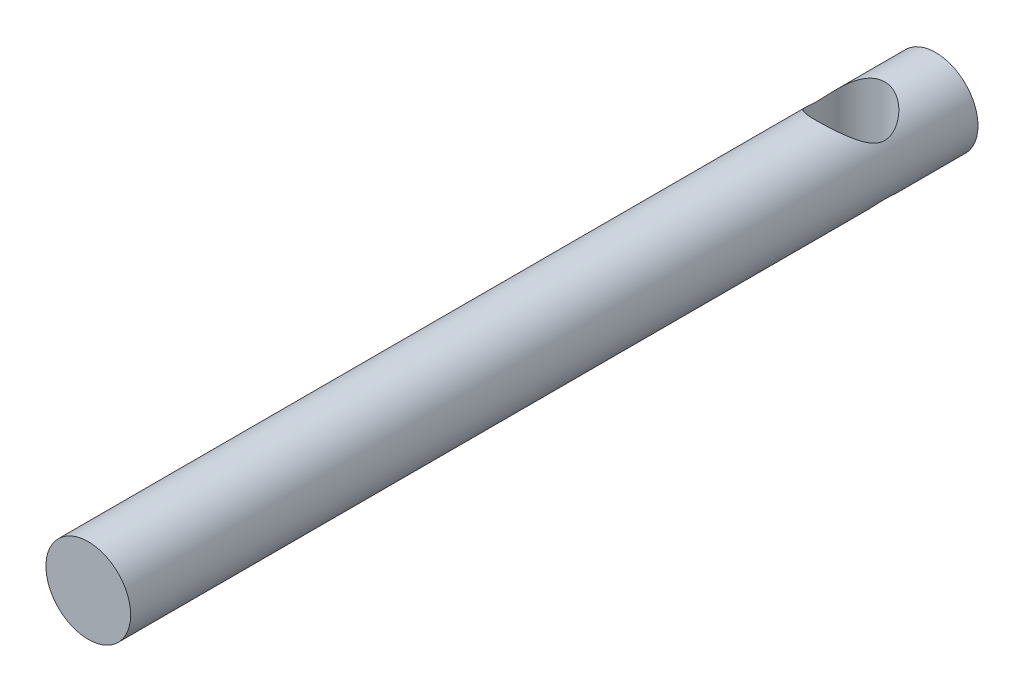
ISO-10303-21;
HEADER;
FILE_DESCRIPTION(('STEP AP214'),'2;1');
FILE_NAME('part.step','',(''),(''),'','','');
FILE_SCHEMA(('AUTOMOTIVE_DESIGN { 1 0 10303 214 1 1 1 1 }'));
ENDSEC;
DATA;
#1=APPLICATION_CONTEXT('core data for automotive mechanical design processes');
#2=APPLICATION_PROTOCOL_DEFINITION('international standard','automotive_design',2000,#1);
#3=PRODUCT_CONTEXT('',#1,'mechanical');
#4=PRODUCT('Part','Part','',(#3));
#5=PRODUCT_RELATED_PRODUCT_CATEGORY('part','',(#4));
#6=PRODUCT_DEFINITION_FORMATION('','',#4);
#7=PRODUCT_DEFINITION_CONTEXT('part definition',#1,'design');
#8=PRODUCT_DEFINITION('design','',#6,#7);
#9=PRODUCT_DEFINITION_SHAPE('','',#8);
#10=(LENGTH_UNIT() NAMED_UNIT(*) SI_UNIT(.MILLI.,.METRE.));
#11=(NAMED_UNIT(*) PLANE_ANGLE_UNIT() SI_UNIT($,.RADIAN.));
#12=(NAMED_UNIT(*) SI_UNIT($,.STERADIAN.) SOLID_ANGLE_UNIT());
#13=UNCERTAINTY_MEASURE_WITH_UNIT(LENGTH_MEASURE(1.E-05),#10,'distance_accuracy_value','');
#14=(GEOMETRIC_REPRESENTATION_CONTEXT(3) GLOBAL_UNCERTAINTY_ASSIGNED_CONTEXT((#13)) GLOBAL_UNIT_ASSIGNED_CONTEXT((#10,
#11,#12)) REPRESENTATION_CONTEXT('',''));
#15=CARTESIAN_POINT('',(0.,0.,0.));
#16=DIRECTION('',(0.,0.,1.));
#17=DIRECTION('',(1.,0.,0.));
#18=AXIS2_PLACEMENT_3D('',#15,#16,#17);
#19=CARTESIAN_POINT('',(0.,0.,50.));
#20=DIRECTION('',(0.,0.,-1.));
#21=DIRECTION('',(-1.,0.,0.));
#22=AXIS2_PLACEMENT_3D('',#19,#20,#21);
#23=CYLINDRICAL_SURFACE('',#22,5.);
#24=CARTESIAN_POINT('',(0.,-5.,-36.));
#25=CARTESIAN_POINT('',(0.0960463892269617,-4.99999925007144,-36.0000007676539));
#26=CARTESIAN_POINT('',(0.192107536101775,-4.99722609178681,-36.0034657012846));
#27=CARTESIAN_POINT('',(0.383456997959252,-4.98619644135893,-36.0172658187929));
#28=CARTESIAN_POINT('',(0.478744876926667,-4.97793704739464,-36.0276046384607));
#29=CARTESIAN_POINT('',(0.667896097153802,-4.95610616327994,-36.0549958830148));
#30=CARTESIAN_POINT('',(0.76175685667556,-4.94252601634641,-36.0720592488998));
#31=CARTESIAN_POINT('',(0.947221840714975,-4.91036147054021,-36.1126101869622));
#32=CARTESIAN_POINT('',(1.0388250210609,-4.89177480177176,-36.1361006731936));
#33=CARTESIAN_POINT('',(1.30807557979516,-4.82935106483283,-36.2153329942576));
#34=CARTESIAN_POINT('',(1.48159866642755,-4.77867586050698,-36.2800510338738));
#35=CARTESIAN_POINT('',(1.81389737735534,-4.66270676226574,-36.4302503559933));
#36=CARTESIAN_POINT('',(1.97267295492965,-4.59741282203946,-36.5157317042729));
#37=CARTESIAN_POINT('',(2.2248639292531,-4.47912821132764,-36.6736868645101));
#38=CARTESIAN_POINT('',(2.32274021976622,-4.42904400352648,-36.7413473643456));
#39=CARTESIAN_POINT('',(2.51087921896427,-4.3251620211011,-36.8840057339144));
#40=CARTESIAN_POINT('',(2.60114198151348,-4.27136427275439,-36.9590035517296));
#41=CARTESIAN_POINT('',(2.77417073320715,-4.16107388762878,-37.1159636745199));
#42=CARTESIAN_POINT('',(2.85691378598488,-4.10457375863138,-37.1979459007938));
#43=CARTESIAN_POINT('',(3.01451382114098,-3.99026026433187,-37.3682397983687));
#44=CARTESIAN_POINT('',(3.08937383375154,-3.93244741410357,-37.4565490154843));
#45=CARTESIAN_POINT('',(3.23229007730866,-3.81587933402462,-37.6407406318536));
#46=CARTESIAN_POINT('',(3.30022025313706,-3.75712363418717,-37.7367205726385));
#47=CARTESIAN_POINT('',(3.42776995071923,-3.64112939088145,-37.9349832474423));
#48=CARTESIAN_POINT('',(3.48738684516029,-3.58389133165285,-38.0372679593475));
#49=CARTESIAN_POINT('',(3.59782503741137,-3.47300406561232,-38.247927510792));
#50=CARTESIAN_POINT('',(3.64867015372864,-3.41934539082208,-38.3562847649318));
#51=CARTESIAN_POINT('',(3.74117870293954,-3.31787465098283,-38.5793826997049));
#52=CARTESIAN_POINT('',(3.78284998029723,-3.2700576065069,-38.6941178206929));
#53=CARTESIAN_POINT('',(3.86171422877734,-3.17670210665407,-38.947710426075));
#54=CARTESIAN_POINT('',(3.89730775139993,-3.1325716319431,-39.0876106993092));
#55=CARTESIAN_POINT('',(3.95346969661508,-3.06140069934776,-39.3744381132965));
#56=CARTESIAN_POINT('',(3.97407505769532,-3.03431824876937,-39.5213470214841));
#57=CARTESIAN_POINT('',(3.99879637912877,-3.0016839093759,-39.8203813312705));
#58=CARTESIAN_POINT('',(4.00276700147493,-2.99632180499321,-39.9725410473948));
#59=CARTESIAN_POINT('',(3.99338954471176,-3.00879937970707,-40.2754117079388));
#60=CARTESIAN_POINT('',(3.98002680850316,-3.02665869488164,-40.4261213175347));
#61=CARTESIAN_POINT('',(3.93390695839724,-3.08641470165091,-40.7444399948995));
#62=CARTESIAN_POINT('',(3.89843994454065,-3.13163820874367,-40.9109987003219));
#63=CARTESIAN_POINT('',(3.80888715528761,-3.2399478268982,-41.2330884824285));
#64=CARTESIAN_POINT('',(3.75474623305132,-3.30308674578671,-41.388585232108));
#65=CARTESIAN_POINT('',(3.6459308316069,-3.42227632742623,-41.6497837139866));
#66=CARTESIAN_POINT('',(3.59488537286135,-3.4760534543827,-41.7581007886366));
#67=CARTESIAN_POINT('',(3.48415594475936,-3.58703185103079,-41.9684490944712));
#68=CARTESIAN_POINT('',(3.42446798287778,-3.64423469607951,-42.0704773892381));
#69=CARTESIAN_POINT('',(3.29671153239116,-3.76020626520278,-42.2683872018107));
#70=CARTESIAN_POINT('',(3.22863333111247,-3.81897674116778,-42.3642613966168));
#71=CARTESIAN_POINT('',(3.08431402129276,-3.93645333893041,-42.5496673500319));
#72=CARTESIAN_POINT('',(3.00807425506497,-3.99515946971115,-42.639200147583));
#73=CARTESIAN_POINT('',(2.84534419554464,-4.11270704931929,-42.8140101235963));
#74=CARTESIAN_POINT('',(2.75863401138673,-4.17150999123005,-42.8991090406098));
#75=CARTESIAN_POINT('',(2.5767399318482,-4.28625477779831,-43.0619130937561));
#76=CARTESIAN_POINT('',(2.48155479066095,-4.34219619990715,-43.1396171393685));
#77=CARTESIAN_POINT('',(2.28307653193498,-4.44974832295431,-43.2867573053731));
#78=CARTESIAN_POINT('',(2.17980247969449,-4.50136864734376,-43.3562119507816));
#79=CARTESIAN_POINT('',(1.96536649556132,-4.59904750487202,-43.4861249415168));
#80=CARTESIAN_POINT('',(1.85420815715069,-4.64510854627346,-43.5465873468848));
#81=CARTESIAN_POINT('',(1.57560055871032,-4.7484549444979,-43.6810867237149));
#82=CARTESIAN_POINT('',(1.40425498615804,-4.80222795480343,-43.7500220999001));
#83=CARTESIAN_POINT('',(1.13837354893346,-4.86955008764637,-43.8357293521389));
#84=CARTESIAN_POINT('',(1.0482500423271,-4.88977064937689,-43.8613525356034));
#85=CARTESIAN_POINT('',(0.86554055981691,-4.92539137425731,-43.9063630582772));
#86=CARTESIAN_POINT('',(0.772955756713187,-4.94079379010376,-43.9257533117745));
#87=CARTESIAN_POINT('',(0.58541259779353,-4.96651844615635,-43.9580805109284));
#88=CARTESIAN_POINT('',(0.490443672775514,-4.97681103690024,-43.9709797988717));
#89=CARTESIAN_POINT('',(0.299430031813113,-4.99194513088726,-43.9899309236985));
#90=CARTESIAN_POINT('',(0.203385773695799,-4.99678887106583,-43.9959855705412));
#91=CARTESIAN_POINT('',(0.0109789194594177,-5.00091325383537,-44.0011418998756));
#92=CARTESIAN_POINT('',(-0.0853836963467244,-5.00019354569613,-44.0002431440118));
#93=CARTESIAN_POINT('',(-0.277564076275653,-4.9932177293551,-43.9915194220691));
#94=CARTESIAN_POINT('',(-0.373381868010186,-4.9869619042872,-43.9836948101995));
#95=CARTESIAN_POINT('',(-0.643376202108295,-4.96153018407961,-43.9518293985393));
#96=CARTESIAN_POINT('',(-0.816090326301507,-4.93592517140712,-43.9197003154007));
#97=CARTESIAN_POINT('',(-1.15270281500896,-4.86835214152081,-43.8342569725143));
#98=CARTESIAN_POINT('',(-1.31659854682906,-4.82637926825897,-43.7809364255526));
#99=CARTESIAN_POINT('',(-1.64246254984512,-4.72579643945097,-43.6516988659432));
#100=CARTESIAN_POINT('',(-1.80368475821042,-4.66631810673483,-43.5745883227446));
#101=CARTESIAN_POINT('',(-2.11082248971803,-4.53567260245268,-43.4022758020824));
#102=CARTESIAN_POINT('',(-2.25673724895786,-4.4645048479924,-43.3070729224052));
#103=CARTESIAN_POINT('',(-2.55850389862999,-4.29987369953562,-43.0815513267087));
#104=CARTESIAN_POINT('',(-2.71101415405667,-4.20473938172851,-42.9479966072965));
#105=CARTESIAN_POINT('',(-2.99307397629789,-4.00886997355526,-42.6612260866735));
#106=CARTESIAN_POINT('',(-3.12255559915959,-3.90811942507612,-42.5079543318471));
#107=CARTESIAN_POINT('',(-3.31136973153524,-3.74748270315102,-42.2471311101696));
#108=CARTESIAN_POINT('',(-3.3782748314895,-3.68709486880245,-42.1452788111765));
#109=CARTESIAN_POINT('',(-3.50310004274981,-3.56870831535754,-41.9347554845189));
#110=CARTESIAN_POINT('',(-3.5610153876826,-3.51071087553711,-41.8260808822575));
#111=CARTESIAN_POINT('',(-3.6671754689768,-3.39966227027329,-41.602221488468));
#112=CARTESIAN_POINT('',(-3.71545356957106,-3.34659439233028,-41.487060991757));
#113=CARTESIAN_POINT('',(-3.80178930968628,-3.24818077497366,-41.2499190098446));
#114=CARTESIAN_POINT('',(-3.83985955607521,-3.20282553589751,-41.1279461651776));
#115=CARTESIAN_POINT('',(-3.90720331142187,-3.12038840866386,-40.8678265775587));
#116=CARTESIAN_POINT('',(-3.9355911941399,-3.08419433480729,-40.729154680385));
#117=CARTESIAN_POINT('',(-3.9775781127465,-3.02986743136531,-40.4463247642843));
#118=CARTESIAN_POINT('',(-3.9912144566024,-3.01168904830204,-40.302181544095));
#119=CARTESIAN_POINT('',(-4.00264117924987,-2.99649473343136,-40.0113026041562));
#120=CARTESIAN_POINT('',(-4.00034641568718,-2.9995925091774,-39.864557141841));
#121=CARTESIAN_POINT('',(-3.97993037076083,-3.02661544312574,-39.574031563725));
#122=CARTESIAN_POINT('',(-3.96178399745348,-3.05057362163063,-39.4302565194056));
#123=CARTESIAN_POINT('',(-3.90415501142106,-3.12414149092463,-39.1107866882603));
#124=CARTESIAN_POINT('',(-3.8601850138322,-3.17898498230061,-38.9371548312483));
#125=CARTESIAN_POINT('',(-3.75216313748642,-3.30577833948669,-38.6027320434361));
#126=CARTESIAN_POINT('',(-3.68805209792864,-3.37777844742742,-38.4419807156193));
#127=CARTESIAN_POINT('',(-3.56189718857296,-3.50982146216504,-38.1756497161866));
#128=CARTESIAN_POINT('',(-3.50405339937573,-3.56777397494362,-38.0669752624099));
#129=CARTESIAN_POINT('',(-3.3792939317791,-3.68615802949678,-37.8563190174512));
#130=CARTESIAN_POINT('',(-3.31237456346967,-3.74659057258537,-37.7543399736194));
#131=CARTESIAN_POINT('',(-3.16965616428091,-3.86808457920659,-37.5570272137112));
#132=CARTESIAN_POINT('',(-3.09384874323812,-3.92914658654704,-37.4616999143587));
#133=CARTESIAN_POINT('',(-2.93352249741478,-4.05025163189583,-37.2779962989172));
#134=CARTESIAN_POINT('',(-2.84900504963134,-4.11029482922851,-37.1896188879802));
#135=CARTESIAN_POINT('',(-2.67014072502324,-4.22871182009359,-37.019091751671));
#136=CARTESIAN_POINT('',(-2.57567862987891,-4.28705303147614,-36.9370398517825));
#137=CARTESIAN_POINT('',(-2.37797638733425,-4.39979346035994,-36.7811370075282));
#138=CARTESIAN_POINT('',(-2.27473478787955,-4.45419202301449,-36.7072874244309));
#139=CARTESIAN_POINT('',(-2.05999159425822,-4.55747526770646,-36.5688634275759));
#140=CARTESIAN_POINT('',(-1.94851057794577,-4.60637296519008,-36.5042670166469));
#141=CARTESIAN_POINT('',(-1.71770987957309,-4.69732670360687,-36.3852598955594));
#142=CARTESIAN_POINT('',(-1.59839505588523,-4.73938692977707,-36.3308429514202));
#143=CARTESIAN_POINT('',(-1.31004257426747,-4.82841831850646,-36.2164381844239));
#144=CARTESIAN_POINT('',(-1.13806652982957,-4.87206678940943,-36.1610196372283));
#145=CARTESIAN_POINT('',(-0.873484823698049,-4.92393545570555,-36.095475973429));
#146=CARTESIAN_POINT('',(-0.7842574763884,-4.93895148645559,-36.0765663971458));
#147=CARTESIAN_POINT('',(-0.604069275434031,-4.96420704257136,-36.0448202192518));
#148=CARTESIAN_POINT('',(-0.513109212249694,-4.97444869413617,-36.0319809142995));
#149=CARTESIAN_POINT('',(-0.351776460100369,-4.9881031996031,-36.0148786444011));
#150=CARTESIAN_POINT('',(-0.281625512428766,-4.99255849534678,-36.0093051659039));
#151=CARTESIAN_POINT('',(-0.140985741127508,-4.99850750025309,-36.0018651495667));
#152=CARTESIAN_POINT('',(-0.0704968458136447,-5.00000055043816,-35.9999994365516));
#153=CARTESIAN_POINT('',(0.,-5.,-36.));
#154=B_SPLINE_CURVE_WITH_KNOTS('',3,(#24,#25,#26,#27,#28,#29,#30,#31,#32,#33,#34,#35,#36,#37,
#38,#39,#40,#41,#42,#43,#44,#45,#46,#47,#48,#49,#50,#51,#52,#53,#54,#55,#56,#57,#58,#59,#60,#61,
#62,#63,#64,#65,#66,#67,#68,#69,#70,#71,#72,#73,#74,#75,#76,#77,#78,#79,#80,#81,#82,#83,#84,#85,
#86,#87,#88,#89,#90,#91,#92,#93,#94,#95,#96,#97,#98,#99,#100,#101,#102,#103,#104,#105,#106,#107,
#108,#109,#110,#111,#112,#113,#114,#115,#116,#117,#118,#119,#120,#121,#122,#123,#124,#125,#126,
#127,#128,#129,#130,#131,#132,#133,#134,#135,#136,#137,#138,#139,#140,#141,#142,#143,#144,#145,
#146,#147,#148,#149,#150,#151,#152,#153),.UNSPECIFIED.,.T.,.F.,(4,2,2,2,2,2,2,2,2,2,2,2,2,2,2,2,
2,2,2,2,2,2,2,2,2,2,2,2,2,2,2,2,2,2,2,2,2,2,2,2,2,2,2,2,2,2,2,2,2,2,2,2,2,2,2,2,2,2,2,2,2,2,2,2,
4),(0.,0.288062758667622,0.576278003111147,0.864964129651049,1.15378136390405,1.72709009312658,
2.30040063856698,2.68722645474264,3.07404953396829,3.46201544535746,3.84983167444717,
4.24376978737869,4.63783211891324,5.03080698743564,5.42344451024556,5.87474837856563,
6.32493619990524,6.77904922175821,7.23354649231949,7.75923125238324,8.28648192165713,
8.6798007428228,9.07330184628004,9.46726282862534,9.86115911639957,10.2656076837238,
10.6701158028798,11.0736976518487,11.4770967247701,12.0514034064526,12.3386733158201,
12.6258087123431,12.9145912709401,13.2032552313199,13.4919373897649,13.7806047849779,
14.3106110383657,14.8407746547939,15.4037260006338,15.9667054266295,16.6361816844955,
17.3076015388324,17.7152021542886,18.1230181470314,18.5293968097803,18.9352712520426,
19.3719136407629,19.8074491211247,20.2453140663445,20.6838733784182,21.242737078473,
21.8032579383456,22.2109901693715,22.6188886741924,23.0271753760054,23.4353976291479,
23.8490189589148,24.2627088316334,24.675398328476,25.0878342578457,25.6427442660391,
25.9197834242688,26.1966990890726,26.4080865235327,26.6195209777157),.UNSPECIFIED.);
#155=CARTESIAN_POINT('',(0.,-5.,-36.));
#156=VERTEX_POINT('',#155);
#157=EDGE_CURVE('E10',#156,#156,#154,.T.);
#158=ORIENTED_EDGE('',*,*,#157,.T.);
#159=EDGE_LOOP('',(#158));
#160=FACE_BOUND('',#159,.T.);
#161=CARTESIAN_POINT('',(0.,5.,-36.));
#162=CARTESIAN_POINT('',(-0.0960463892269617,4.99999925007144,-36.0000007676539));
#163=CARTESIAN_POINT('',(-0.192107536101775,4.99722609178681,-36.0034657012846));
#164=CARTESIAN_POINT('',(-0.383456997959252,4.98619644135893,-36.0172658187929));
#165=CARTESIAN_POINT('',(-0.478744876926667,4.97793704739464,-36.0276046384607));
#166=CARTESIAN_POINT('',(-0.667896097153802,4.95610616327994,-36.0549958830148));
#167=CARTESIAN_POINT('',(-0.76175685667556,4.94252601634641,-36.0720592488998));
#168=CARTESIAN_POINT('',(-0.947221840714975,4.91036147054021,-36.1126101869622));
#169=CARTESIAN_POINT('',(-1.0388250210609,4.89177480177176,-36.1361006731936));
#170=CARTESIAN_POINT('',(-1.30807557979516,4.82935106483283,-36.2153329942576));
#171=CARTESIAN_POINT('',(-1.48159866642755,4.77867586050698,-36.2800510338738));
#172=CARTESIAN_POINT('',(-1.81389737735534,4.66270676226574,-36.4302503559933));
#173=CARTESIAN_POINT('',(-1.97267295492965,4.59741282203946,-36.5157317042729));
#174=CARTESIAN_POINT('',(-2.2248639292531,4.47912821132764,-36.6736868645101));
#175=CARTESIAN_POINT('',(-2.32274021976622,4.42904400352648,-36.7413473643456));
#176=CARTESIAN_POINT('',(-2.51087921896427,4.3251620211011,-36.8840057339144));
#177=CARTESIAN_POINT('',(-2.60114198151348,4.27136427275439,-36.9590035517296));
#178=CARTESIAN_POINT('',(-2.77417073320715,4.16107388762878,-37.1159636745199));
#179=CARTESIAN_POINT('',(-2.85691378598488,4.10457375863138,-37.1979459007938));
#180=CARTESIAN_POINT('',(-3.01451382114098,3.99026026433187,-37.3682397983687));
#181=CARTESIAN_POINT('',(-3.08937383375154,3.93244741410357,-37.4565490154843));
#182=CARTESIAN_POINT('',(-3.23229007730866,3.81587933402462,-37.6407406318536));
#183=CARTESIAN_POINT('',(-3.30022025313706,3.75712363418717,-37.7367205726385));
#184=CARTESIAN_POINT('',(-3.42776995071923,3.64112939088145,-37.9349832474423));
#185=CARTESIAN_POINT('',(-3.48738684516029,3.58389133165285,-38.0372679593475));
#186=CARTESIAN_POINT('',(-3.59782503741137,3.47300406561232,-38.247927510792));
#187=CARTESIAN_POINT('',(-3.64867015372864,3.41934539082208,-38.3562847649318));
#188=CARTESIAN_POINT('',(-3.74117870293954,3.31787465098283,-38.5793826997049));
#189=CARTESIAN_POINT('',(-3.78284998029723,3.2700576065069,-38.6941178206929));
#190=CARTESIAN_POINT('',(-3.86171422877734,3.17670210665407,-38.947710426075));
#191=CARTESIAN_POINT('',(-3.89730775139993,3.1325716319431,-39.0876106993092));
#192=CARTESIAN_POINT('',(-3.95346969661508,3.06140069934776,-39.3744381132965));
#193=CARTESIAN_POINT('',(-3.97407505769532,3.03431824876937,-39.5213470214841));
#194=CARTESIAN_POINT('',(-3.99879637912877,3.0016839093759,-39.8203813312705));
#195=CARTESIAN_POINT('',(-4.00276700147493,2.99632180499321,-39.9725410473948));
#196=CARTESIAN_POINT('',(-3.99338954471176,3.00879937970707,-40.2754117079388));
#197=CARTESIAN_POINT('',(-3.98002680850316,3.02665869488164,-40.4261213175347));
#198=CARTESIAN_POINT('',(-3.93390695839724,3.08641470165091,-40.7444399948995));
#199=CARTESIAN_POINT('',(-3.89843994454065,3.13163820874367,-40.9109987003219));
#200=CARTESIAN_POINT('',(-3.80888715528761,3.2399478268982,-41.2330884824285));
#201=CARTESIAN_POINT('',(-3.75474623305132,3.30308674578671,-41.388585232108));
#202=CARTESIAN_POINT('',(-3.6459308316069,3.42227632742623,-41.6497837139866));
#203=CARTESIAN_POINT('',(-3.59488537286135,3.4760534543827,-41.7581007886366));
#204=CARTESIAN_POINT('',(-3.48415594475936,3.58703185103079,-41.9684490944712));
#205=CARTESIAN_POINT('',(-3.42446798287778,3.64423469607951,-42.0704773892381));
#206=CARTESIAN_POINT('',(-3.29671153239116,3.76020626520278,-42.2683872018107));
#207=CARTESIAN_POINT('',(-3.22863333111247,3.81897674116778,-42.3642613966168));
#208=CARTESIAN_POINT('',(-3.08431402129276,3.93645333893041,-42.5496673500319));
#209=CARTESIAN_POINT('',(-3.00807425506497,3.99515946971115,-42.639200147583));
#210=CARTESIAN_POINT('',(-2.84534419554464,4.11270704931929,-42.8140101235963));
#211=CARTESIAN_POINT('',(-2.75863401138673,4.17150999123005,-42.8991090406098));
#212=CARTESIAN_POINT('',(-2.5767399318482,4.28625477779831,-43.0619130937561));
#213=CARTESIAN_POINT('',(-2.48155479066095,4.34219619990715,-43.1396171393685));
#214=CARTESIAN_POINT('',(-2.28307653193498,4.44974832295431,-43.2867573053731));
#215=CARTESIAN_POINT('',(-2.17980247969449,4.50136864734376,-43.3562119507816));
#216=CARTESIAN_POINT('',(-1.96536649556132,4.59904750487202,-43.4861249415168));
#217=CARTESIAN_POINT('',(-1.85420815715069,4.64510854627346,-43.5465873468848));
#218=CARTESIAN_POINT('',(-1.57560055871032,4.7484549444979,-43.6810867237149));
#219=CARTESIAN_POINT('',(-1.40425498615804,4.80222795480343,-43.7500220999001));
#220=CARTESIAN_POINT('',(-1.13837354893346,4.86955008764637,-43.8357293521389));
#221=CARTESIAN_POINT('',(-1.0482500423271,4.88977064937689,-43.8613525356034));
#222=CARTESIAN_POINT('',(-0.86554055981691,4.92539137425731,-43.9063630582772));
#223=CARTESIAN_POINT('',(-0.772955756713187,4.94079379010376,-43.9257533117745));
#224=CARTESIAN_POINT('',(-0.58541259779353,4.96651844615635,-43.9580805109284));
#225=CARTESIAN_POINT('',(-0.490443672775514,4.97681103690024,-43.9709797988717));
#226=CARTESIAN_POINT('',(-0.299430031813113,4.99194513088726,-43.9899309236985));
#227=CARTESIAN_POINT('',(-0.203385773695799,4.99678887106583,-43.9959855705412));
#228=CARTESIAN_POINT('',(-0.0109789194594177,5.00091325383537,-44.0011418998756));
#229=CARTESIAN_POINT('',(0.0853836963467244,5.00019354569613,-44.0002431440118));
#230=CARTESIAN_POINT('',(0.277564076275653,4.9932177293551,-43.9915194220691));
#231=CARTESIAN_POINT('',(0.373381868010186,4.9869619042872,-43.9836948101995));
#232=CARTESIAN_POINT('',(0.643376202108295,4.96153018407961,-43.9518293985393));
#233=CARTESIAN_POINT('',(0.816090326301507,4.93592517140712,-43.9197003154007));
#234=CARTESIAN_POINT('',(1.15270281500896,4.86835214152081,-43.8342569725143));
#235=CARTESIAN_POINT('',(1.31659854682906,4.82637926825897,-43.7809364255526));
#236=CARTESIAN_POINT('',(1.64246254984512,4.72579643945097,-43.6516988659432));
#237=CARTESIAN_POINT('',(1.80368475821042,4.66631810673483,-43.5745883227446));
#238=CARTESIAN_POINT('',(2.11082248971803,4.53567260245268,-43.4022758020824));
#239=CARTESIAN_POINT('',(2.25673724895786,4.4645048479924,-43.3070729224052));
#240=CARTESIAN_POINT('',(2.55850389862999,4.29987369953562,-43.0815513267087));
#241=CARTESIAN_POINT('',(2.71101415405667,4.20473938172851,-42.9479966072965));
#242=CARTESIAN_POINT('',(2.99307397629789,4.00886997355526,-42.6612260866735));
#243=CARTESIAN_POINT('',(3.12255559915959,3.90811942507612,-42.5079543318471));
#244=CARTESIAN_POINT('',(3.31136973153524,3.74748270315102,-42.2471311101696));
#245=CARTESIAN_POINT('',(3.3782748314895,3.68709486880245,-42.1452788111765));
#246=CARTESIAN_POINT('',(3.50310004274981,3.56870831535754,-41.9347554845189));
#247=CARTESIAN_POINT('',(3.5610153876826,3.51071087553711,-41.8260808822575));
#248=CARTESIAN_POINT('',(3.6671754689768,3.39966227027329,-41.602221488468));
#249=CARTESIAN_POINT('',(3.71545356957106,3.34659439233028,-41.487060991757));
#250=CARTESIAN_POINT('',(3.80178930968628,3.24818077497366,-41.2499190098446));
#251=CARTESIAN_POINT('',(3.83985955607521,3.20282553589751,-41.1279461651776));
#252=CARTESIAN_POINT('',(3.90720331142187,3.12038840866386,-40.8678265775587));
#253=CARTESIAN_POINT('',(3.9355911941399,3.08419433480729,-40.729154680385));
#254=CARTESIAN_POINT('',(3.9775781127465,3.02986743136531,-40.4463247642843));
#255=CARTESIAN_POINT('',(3.9912144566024,3.01168904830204,-40.302181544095));
#256=CARTESIAN_POINT('',(4.00264117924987,2.99649473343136,-40.0113026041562));
#257=CARTESIAN_POINT('',(4.00034641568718,2.9995925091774,-39.864557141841));
#258=CARTESIAN_POINT('',(3.97993037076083,3.02661544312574,-39.574031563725));
#259=CARTESIAN_POINT('',(3.96178399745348,3.05057362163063,-39.4302565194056));
#260=CARTESIAN_POINT('',(3.90415501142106,3.12414149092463,-39.1107866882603));
#261=CARTESIAN_POINT('',(3.8601850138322,3.17898498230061,-38.9371548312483));
#262=CARTESIAN_POINT('',(3.75216313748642,3.30577833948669,-38.6027320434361));
#263=CARTESIAN_POINT('',(3.68805209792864,3.37777844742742,-38.4419807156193));
#264=CARTESIAN_POINT('',(3.56189718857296,3.50982146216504,-38.1756497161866));
#265=CARTESIAN_POINT('',(3.50405339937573,3.56777397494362,-38.0669752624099));
#266=CARTESIAN_POINT('',(3.3792939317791,3.68615802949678,-37.8563190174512));
#267=CARTESIAN_POINT('',(3.31237456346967,3.74659057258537,-37.7543399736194));
#268=CARTESIAN_POINT('',(3.16965616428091,3.86808457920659,-37.5570272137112));
#269=CARTESIAN_POINT('',(3.09384874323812,3.92914658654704,-37.4616999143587));
#270=CARTESIAN_POINT('',(2.93352249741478,4.05025163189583,-37.2779962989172));
#271=CARTESIAN_POINT('',(2.84900504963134,4.11029482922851,-37.1896188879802));
#272=CARTESIAN_POINT('',(2.67014072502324,4.22871182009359,-37.019091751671));
#273=CARTESIAN_POINT('',(2.57567862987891,4.28705303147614,-36.9370398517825));
#274=CARTESIAN_POINT('',(2.37797638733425,4.39979346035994,-36.7811370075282));
#275=CARTESIAN_POINT('',(2.27473478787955,4.45419202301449,-36.7072874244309));
#276=CARTESIAN_POINT('',(2.05999159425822,4.55747526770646,-36.5688634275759));
#277=CARTESIAN_POINT('',(1.94851057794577,4.60637296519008,-36.5042670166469));
#278=CARTESIAN_POINT('',(1.71770987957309,4.69732670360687,-36.3852598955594));
#279=CARTESIAN_POINT('',(1.59839505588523,4.73938692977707,-36.3308429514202));
#280=CARTESIAN_POINT('',(1.31004257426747,4.82841831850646,-36.2164381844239));
#281=CARTESIAN_POINT('',(1.13806652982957,4.87206678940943,-36.1610196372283));
#282=CARTESIAN_POINT('',(0.873484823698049,4.92393545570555,-36.095475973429));
#283=CARTESIAN_POINT('',(0.7842574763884,4.93895148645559,-36.0765663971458));
#284=CARTESIAN_POINT('',(0.604069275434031,4.96420704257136,-36.0448202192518));
#285=CARTESIAN_POINT('',(0.513109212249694,4.97444869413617,-36.0319809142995));
#286=CARTESIAN_POINT('',(0.351776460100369,4.9881031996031,-36.0148786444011));
#287=CARTESIAN_POINT('',(0.281625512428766,4.99255849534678,-36.0093051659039));
#288=CARTESIAN_POINT('',(0.140985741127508,4.99850750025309,-36.0018651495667));
#289=CARTESIAN_POINT('',(0.0704968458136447,5.00000055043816,-35.9999994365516));
#290=CARTESIAN_POINT('',(0.,5.,-36.));
#291=B_SPLINE_CURVE_WITH_KNOTS('',3,(#161,#162,#163,#164,#165,#166,#167,#168,#169,#170,#171,
#172,#173,#174,#175,#176,#177,#178,#179,#180,#181,#182,#183,#184,#185,#186,#187,#188,#189,#190,
#191,#192,#193,#194,#195,#196,#197,#198,#199,#200,#201,#202,#203,#204,#205,#206,#207,#208,#209,
#210,#211,#212,#213,#214,#215,#216,#217,#218,#219,#220,#221,#222,#223,#224,#225,#226,#227,#228,
#229,#230,#231,#232,#233,#234,#235,#236,#237,#238,#239,#240,#241,#242,#243,#244,#245,#246,#247,
#248,#249,#250,#251,#252,#253,#254,#255,#256,#257,#258,#259,#260,#261,#262,#263,#264,#265,#266,
#267,#268,#269,#270,#271,#272,#273,#274,#275,#276,#277,#278,#279,#280,#281,#282,#283,#284,#285,
#286,#287,#288,#289,#290),.UNSPECIFIED.,.T.,.F.,(4,2,2,2,2,2,2,2,2,2,2,2,2,2,2,2,2,2,2,2,2,2,2,
2,2,2,2,2,2,2,2,2,2,2,2,2,2,2,2,2,2,2,2,2,2,2,2,2,2,2,2,2,2,2,2,2,2,2,2,2,2,2,2,2,4),(0.,
0.288062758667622,0.576278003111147,0.864964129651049,1.15378136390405,1.72709009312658,
2.30040063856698,2.68722645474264,3.07404953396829,3.46201544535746,3.84983167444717,
4.24376978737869,4.63783211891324,5.03080698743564,5.42344451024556,5.87474837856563,
6.32493619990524,6.77904922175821,7.23354649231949,7.75923125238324,8.28648192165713,
8.6798007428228,9.07330184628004,9.46726282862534,9.86115911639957,10.2656076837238,
10.6701158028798,11.0736976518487,11.4770967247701,12.0514034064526,12.3386733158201,
12.6258087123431,12.9145912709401,13.2032552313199,13.4919373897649,13.7806047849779,
14.3106110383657,14.8407746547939,15.4037260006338,15.9667054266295,16.6361816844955,
17.3076015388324,17.7152021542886,18.1230181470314,18.5293968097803,18.9352712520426,
19.3719136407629,19.8074491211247,20.2453140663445,20.6838733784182,21.242737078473,
21.8032579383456,22.2109901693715,22.6188886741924,23.0271753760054,23.4353976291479,
23.8490189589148,24.2627088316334,24.675398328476,25.0878342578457,25.6427442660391,
25.9197834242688,26.1966990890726,26.4080865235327,26.6195209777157),.UNSPECIFIED.);
#292=CARTESIAN_POINT('',(0.,5.,-36.));
#293=VERTEX_POINT('',#292);
#294=EDGE_CURVE('E377',#293,#293,#291,.T.);
#295=ORIENTED_EDGE('',*,*,#294,.T.);
#296=EDGE_LOOP('',(#295));
#297=FACE_BOUND('',#296,.T.);
#298=CARTESIAN_POINT('',(0.,0.,50.));
#299=DIRECTION('',(0.,0.,1.));
#300=DIRECTION('',(1.,0.,0.));
#301=AXIS2_PLACEMENT_3D('',#298,#299,#300);
#302=CIRCLE('',#301,5.);
#303=CARTESIAN_POINT('',(5.,0.,50.));
#304=VERTEX_POINT('',#303);
#305=EDGE_CURVE('E381',#304,#304,#302,.T.);
#306=ORIENTED_EDGE('',*,*,#305,.F.);
#307=EDGE_LOOP('',(#306));
#308=FACE_BOUND('',#307,.T.);
#309=CARTESIAN_POINT('',(0.,0.,-50.));
#310=DIRECTION('',(0.,0.,1.));
#311=DIRECTION('',(1.,0.,0.));
#312=AXIS2_PLACEMENT_3D('',#309,#310,#311);
#313=CIRCLE('',#312,5.);
#314=CARTESIAN_POINT('',(5.,0.,-50.));
#315=VERTEX_POINT('',#314);
#316=EDGE_CURVE('E385',#315,#315,#313,.T.);
#317=ORIENTED_EDGE('',*,*,#316,.T.);
#318=EDGE_LOOP('',(#317));
#319=FACE_BOUND('',#318,.T.);
#320=ADVANCED_FACE('F367',(#160,#297,#308,#319),#23,.T.);
#321=CARTESIAN_POINT('',(0.,0.,50.));
#322=DIRECTION('',(0.,0.,1.));
#323=DIRECTION('',(1.,0.,0.));
#324=AXIS2_PLACEMENT_3D('',#321,#322,#323);
#325=PLANE('',#324);
#326=ORIENTED_EDGE('',*,*,#305,.T.);
#327=EDGE_LOOP('',(#326));
#328=FACE_BOUND('',#327,.T.);
#329=ADVANCED_FACE('F398',(#328),#325,.T.);
#330=CARTESIAN_POINT('',(0.,0.,-50.));
#331=DIRECTION('',(0.,0.,1.));
#332=DIRECTION('',(1.,0.,0.));
#333=AXIS2_PLACEMENT_3D('',#330,#331,#332);
#334=PLANE('',#333);
#335=ORIENTED_EDGE('',*,*,#316,.F.);
#336=EDGE_LOOP('',(#335));
#337=FACE_BOUND('',#336,.T.);
#338=ADVANCED_FACE('F394',(#337),#334,.F.);
#339=CARTESIAN_POINT('',(0.,-5.,-40.));
#340=DIRECTION('',(0.,1.,0.));
#341=DIRECTION('',(0.,0.,1.));
#342=AXIS2_PLACEMENT_3D('',#339,#340,#341);
#343=CYLINDRICAL_SURFACE('',#342,4.);
#344=ORIENTED_EDGE('',*,*,#294,.F.);
#345=EDGE_LOOP('',(#344));
#346=FACE_BOUND('',#345,.T.);
#347=ORIENTED_EDGE('',*,*,#157,.F.);
#348=EDGE_LOOP('',(#347));
#349=FACE_BOUND('',#348,.T.);
#350=ADVANCED_FACE('F390',(#346,#349),#343,.F.);
#351=CLOSED_SHELL('',(#320,#329,#338,#350));
#352=MANIFOLD_SOLID_BREP('B2',#351);
#353=ADVANCED_BREP_SHAPE_REPRESENTATION('',(#18,#352),#14);
#354=SHAPE_DEFINITION_REPRESENTATION(#9,#353);
ENDSEC;
END-ISO-10303-21;
